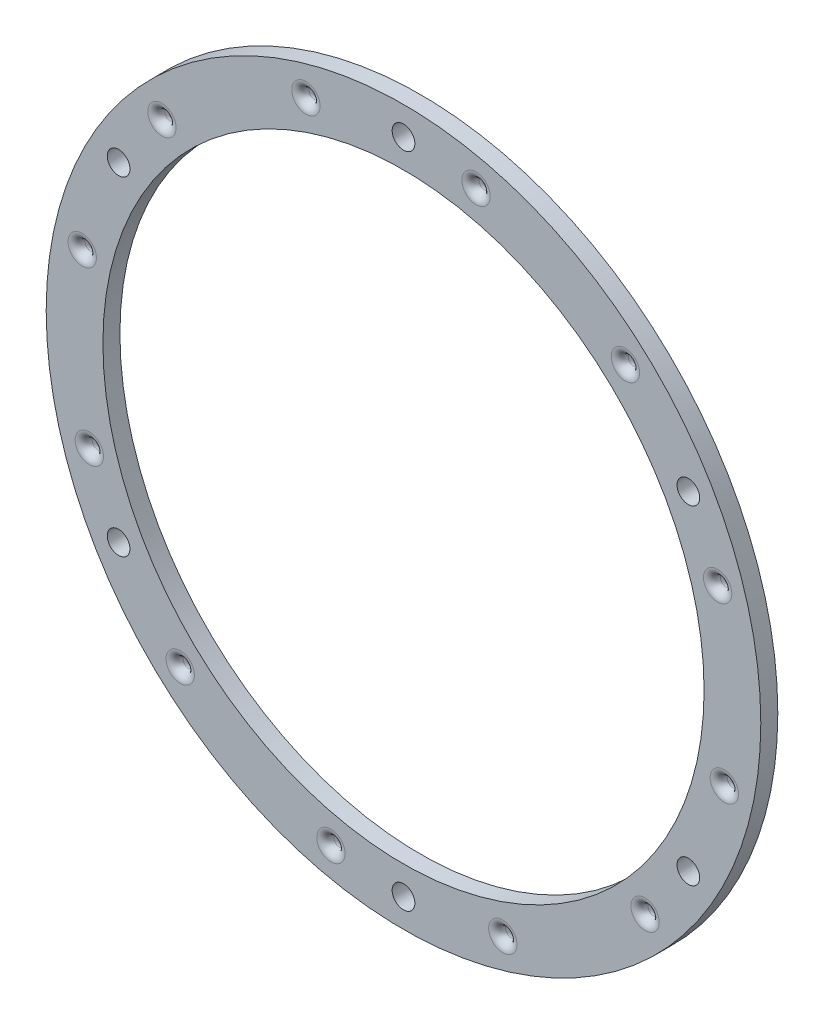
ISO-10303-21;
HEADER;
FILE_DESCRIPTION(('STEP AP214'),'2;1');
FILE_NAME('part.step','',(''),(''),'','','');
FILE_SCHEMA(('AUTOMOTIVE_DESIGN { 1 0 10303 214 1 1 1 1 }'));
ENDSEC;
DATA;
#1=APPLICATION_CONTEXT('core data for automotive mechanical design processes');
#2=APPLICATION_PROTOCOL_DEFINITION('international standard','automotive_design',2000,#1);
#3=PRODUCT_CONTEXT('',#1,'mechanical');
#4=PRODUCT('Part','Part','',(#3));
#5=PRODUCT_RELATED_PRODUCT_CATEGORY('part','',(#4));
#6=PRODUCT_DEFINITION_FORMATION('','',#4);
#7=PRODUCT_DEFINITION_CONTEXT('part definition',#1,'design');
#8=PRODUCT_DEFINITION('design','',#6,#7);
#9=PRODUCT_DEFINITION_SHAPE('','',#8);
#10=(LENGTH_UNIT() NAMED_UNIT(*) SI_UNIT(.MILLI.,.METRE.));
#11=(NAMED_UNIT(*) PLANE_ANGLE_UNIT() SI_UNIT($,.RADIAN.));
#12=(NAMED_UNIT(*) SI_UNIT($,.STERADIAN.) SOLID_ANGLE_UNIT());
#13=UNCERTAINTY_MEASURE_WITH_UNIT(LENGTH_MEASURE(1.E-05),#10,'distance_accuracy_value','');
#14=(GEOMETRIC_REPRESENTATION_CONTEXT(3) GLOBAL_UNCERTAINTY_ASSIGNED_CONTEXT((#13)) GLOBAL_UNIT_ASSIGNED_CONTEXT((#10,
#11,#12)) REPRESENTATION_CONTEXT('',''));
#15=CARTESIAN_POINT('',(0.,0.,0.));
#16=DIRECTION('',(0.,0.,1.));
#17=DIRECTION('',(1.,0.,0.));
#18=AXIS2_PLACEMENT_3D('',#15,#16,#17);
#19=CARTESIAN_POINT('',(0.,0.,3.));
#20=DIRECTION('',(0.,0.,1.));
#21=DIRECTION('',(1.,0.,0.));
#22=AXIS2_PLACEMENT_3D('',#19,#20,#21);
#23=PLANE('',#22);
#24=CARTESIAN_POINT('',(12.79627582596,56.5707992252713,3.));
#25=DIRECTION('',(0.,0.,1.));
#26=DIRECTION('',(1.,0.,0.));
#27=AXIS2_PLACEMENT_3D('',#24,#25,#26);
#28=CIRCLE('',#27,2.5);
#29=CARTESIAN_POINT('',(15.29627582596,56.5707992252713,3.));
#30=VERTEX_POINT('',#29);
#31=EDGE_CURVE('E10',#30,#30,#28,.F.);
#32=ORIENTED_EDGE('',*,*,#31,.T.);
#33=EDGE_LOOP('',(#32));
#34=FACE_BOUND('',#33,.T.);
#35=CARTESIAN_POINT('',(39.1279323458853,42.8136066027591,3.));
#36=DIRECTION('',(0.,0.,1.));
#37=DIRECTION('',(1.,0.,0.));
#38=AXIS2_PLACEMENT_3D('',#35,#36,#37);
#39=CIRCLE('',#38,2.5);
#40=CARTESIAN_POINT('',(41.6279323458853,42.8136066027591,3.));
#41=VERTEX_POINT('',#40);
#42=EDGE_CURVE('E52',#41,#41,#39,.F.);
#43=ORIENTED_EDGE('',*,*,#42,.T.);
#44=EDGE_LOOP('',(#43));
#45=FACE_BOUND('',#44,.T.);
#46=CARTESIAN_POINT('',(55.38988715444,17.2034996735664,3.));
#47=DIRECTION('',(0.,0.,1.));
#48=DIRECTION('',(1.,0.,0.));
#49=AXIS2_PLACEMENT_3D('',#46,#47,#48);
#50=CIRCLE('',#49,2.5);
#51=CARTESIAN_POINT('',(57.88988715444,17.2034996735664,3.));
#52=VERTEX_POINT('',#51);
#53=EDGE_CURVE('E60',#52,#52,#50,.F.);
#54=ORIENTED_EDGE('',*,*,#53,.T.);
#55=EDGE_LOOP('',(#54));
#56=FACE_BOUND('',#55,.T.);
#57=CARTESIAN_POINT('',(56.5707992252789,-12.7962758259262,3.));
#58=DIRECTION('',(0.,0.,1.));
#59=DIRECTION('',(1.,0.,0.));
#60=AXIS2_PLACEMENT_3D('',#57,#58,#59);
#61=CIRCLE('',#60,2.5);
#62=CARTESIAN_POINT('',(59.0707992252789,-12.7962758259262,3.));
#63=VERTEX_POINT('',#62);
#64=EDGE_CURVE('E251',#63,#63,#61,.F.);
#65=ORIENTED_EDGE('',*,*,#64,.T.);
#66=EDGE_LOOP('',(#65));
#67=FACE_BOUND('',#66,.T.);
#68=CARTESIAN_POINT('',(42.5936113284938,-39.3672995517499,3.));
#69=DIRECTION('',(0.,0.,1.));
#70=DIRECTION('',(1.,0.,0.));
#71=AXIS2_PLACEMENT_3D('',#68,#69,#70);
#72=CIRCLE('',#71,2.5);
#73=CARTESIAN_POINT('',(45.0936113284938,-39.3672995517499,3.));
#74=VERTEX_POINT('',#73);
#75=EDGE_CURVE('E240',#74,#74,#72,.F.);
#76=ORIENTED_EDGE('',*,*,#75,.T.);
#77=EDGE_LOOP('',(#76));
#78=FACE_BOUND('',#77,.T.);
#79=CARTESIAN_POINT('',(17.5137047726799,-55.2925867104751,3.));
#80=DIRECTION('',(0.,0.,1.));
#81=DIRECTION('',(1.,0.,0.));
#82=AXIS2_PLACEMENT_3D('',#79,#80,#81);
#83=CIRCLE('',#82,2.5);
#84=CARTESIAN_POINT('',(20.0137047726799,-55.2925867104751,3.));
#85=VERTEX_POINT('',#84);
#86=EDGE_CURVE('E233',#85,#85,#83,.F.);
#87=ORIENTED_EDGE('',*,*,#86,.T.);
#88=EDGE_LOOP('',(#87));
#89=FACE_BOUND('',#88,.T.);
#90=CARTESIAN_POINT('',(-12.7962758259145,-56.5707992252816,3.));
#91=DIRECTION('',(0.,0.,1.));
#92=DIRECTION('',(1.,0.,0.));
#93=AXIS2_PLACEMENT_3D('',#90,#91,#92);
#94=CIRCLE('',#93,2.5);
#95=CARTESIAN_POINT('',(-10.2962758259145,-56.5707992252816,3.));
#96=VERTEX_POINT('',#95);
#97=EDGE_CURVE('E230',#96,#96,#94,.F.);
#98=ORIENTED_EDGE('',*,*,#97,.T.);
#99=EDGE_LOOP('',(#98));
#100=FACE_BOUND('',#99,.T.);
#101=CARTESIAN_POINT('',(-39.3672995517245,-42.5936113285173,3.));
#102=DIRECTION('',(0.,0.,1.));
#103=DIRECTION('',(1.,0.,0.));
#104=AXIS2_PLACEMENT_3D('',#101,#102,#103);
#105=CIRCLE('',#104,2.5);
#106=CARTESIAN_POINT('',(-36.8672995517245,-42.5936113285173,3.));
#107=VERTEX_POINT('',#106);
#108=EDGE_CURVE('E234',#107,#107,#105,.F.);
#109=ORIENTED_EDGE('',*,*,#108,.T.);
#110=EDGE_LOOP('',(#109));
#111=FACE_BOUND('',#110,.T.);
#112=CARTESIAN_POINT('',(-55.3898871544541,-17.2034996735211,3.));
#113=DIRECTION('',(0.,0.,1.));
#114=DIRECTION('',(1.,0.,0.));
#115=AXIS2_PLACEMENT_3D('',#112,#113,#114);
#116=CIRCLE('',#115,2.5);
#117=CARTESIAN_POINT('',(-52.8898871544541,-17.2034996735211,3.));
#118=VERTEX_POINT('',#117);
#119=EDGE_CURVE('E244',#118,#118,#116,.F.);
#120=ORIENTED_EDGE('',*,*,#119,.T.);
#121=EDGE_LOOP('',(#120));
#122=FACE_BOUND('',#121,.T.);
#123=CARTESIAN_POINT('',(-56.6416371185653,12.478980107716,3.));
#124=DIRECTION('',(0.,0.,1.));
#125=DIRECTION('',(1.,0.,0.));
#126=AXIS2_PLACEMENT_3D('',#123,#124,#125);
#127=CIRCLE('',#126,2.5);
#128=CARTESIAN_POINT('',(-54.1416371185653,12.478980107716,3.));
#129=VERTEX_POINT('',#128);
#130=EDGE_CURVE('E305',#129,#129,#127,.F.);
#131=ORIENTED_EDGE('',*,*,#130,.T.);
#132=EDGE_LOOP('',(#131));
#133=FACE_BOUND('',#132,.T.);
#134=CARTESIAN_POINT('',(-42.5936113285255,39.3672995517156,3.));
#135=DIRECTION('',(0.,0.,1.));
#136=DIRECTION('',(1.,0.,0.));
#137=AXIS2_PLACEMENT_3D('',#134,#135,#136);
#138=CIRCLE('',#137,2.5);
#139=CARTESIAN_POINT('',(-40.0936113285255,39.3672995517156,3.));
#140=VERTEX_POINT('',#139);
#141=EDGE_CURVE('E301',#140,#140,#138,.F.);
#142=ORIENTED_EDGE('',*,*,#141,.T.);
#143=EDGE_LOOP('',(#142));
#144=FACE_BOUND('',#143,.T.);
#145=CARTESIAN_POINT('',(-17.2034996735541,55.3898871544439,3.));
#146=DIRECTION('',(0.,0.,1.));
#147=DIRECTION('',(1.,0.,0.));
#148=AXIS2_PLACEMENT_3D('',#145,#146,#147);
#149=CIRCLE('',#148,2.5);
#150=CARTESIAN_POINT('',(-14.7034996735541,55.3898871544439,3.));
#151=VERTEX_POINT('',#150);
#152=EDGE_CURVE('E297',#151,#151,#149,.F.);
#153=ORIENTED_EDGE('',*,*,#152,.T.);
#154=EDGE_LOOP('',(#153));
#155=FACE_BOUND('',#154,.T.);
#156=CARTESIAN_POINT('',(0.,-58.0000000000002,3.));
#157=DIRECTION('',(0.,0.,1.));
#158=DIRECTION('',(1.,0.,0.));
#159=AXIS2_PLACEMENT_3D('',#156,#157,#158);
#160=CIRCLE('',#159,2.0000000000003);
#161=CARTESIAN_POINT('',(2.00000000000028,-58.0000000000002,3.));
#162=VERTEX_POINT('',#161);
#163=EDGE_CURVE('E389',#162,#162,#160,.T.);
#164=ORIENTED_EDGE('',*,*,#163,.F.);
#165=EDGE_LOOP('',(#164));
#166=FACE_BOUND('',#165,.T.);
#167=CARTESIAN_POINT('',(50.2294734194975,-29.0000000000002,3.));
#168=DIRECTION('',(0.,0.,1.));
#169=DIRECTION('',(1.,0.,0.));
#170=AXIS2_PLACEMENT_3D('',#167,#168,#169);
#171=CIRCLE('',#170,2.00000000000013);
#172=CARTESIAN_POINT('',(52.2294734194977,-29.0000000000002,3.));
#173=VERTEX_POINT('',#172);
#174=EDGE_CURVE('E394',#173,#173,#171,.T.);
#175=ORIENTED_EDGE('',*,*,#174,.F.);
#176=EDGE_LOOP('',(#175));
#177=FACE_BOUND('',#176,.T.);
#178=CARTESIAN_POINT('',(50.2294734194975,28.9999999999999,3.));
#179=DIRECTION('',(0.,0.,1.));
#180=DIRECTION('',(1.,0.,0.));
#181=AXIS2_PLACEMENT_3D('',#178,#179,#180);
#182=CIRCLE('',#181,2.00000000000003);
#183=CARTESIAN_POINT('',(52.2294734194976,28.9999999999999,3.));
#184=VERTEX_POINT('',#183);
#185=EDGE_CURVE('E400',#184,#184,#182,.T.);
#186=ORIENTED_EDGE('',*,*,#185,.F.);
#187=EDGE_LOOP('',(#186));
#188=FACE_BOUND('',#187,.T.);
#189=CARTESIAN_POINT('',(0.,0.,3.));
#190=DIRECTION('',(0.,0.,1.));
#191=DIRECTION('',(1.,0.,0.));
#192=AXIS2_PLACEMENT_3D('',#189,#190,#191);
#193=CIRCLE('',#192,53.);
#194=CARTESIAN_POINT('',(53.,0.,3.));
#195=VERTEX_POINT('',#194);
#196=EDGE_CURVE('E406',#195,#195,#193,.T.);
#197=ORIENTED_EDGE('',*,*,#196,.F.);
#198=EDGE_LOOP('',(#197));
#199=FACE_BOUND('',#198,.T.);
#200=CARTESIAN_POINT('',(0.,0.,3.));
#201=DIRECTION('',(0.,0.,1.));
#202=DIRECTION('',(1.,0.,0.));
#203=AXIS2_PLACEMENT_3D('',#200,#201,#202);
#204=CIRCLE('',#203,63.);
#205=CARTESIAN_POINT('',(63.,0.,3.));
#206=VERTEX_POINT('',#205);
#207=EDGE_CURVE('E417',#206,#206,#204,.T.);
#208=ORIENTED_EDGE('',*,*,#207,.T.);
#209=EDGE_LOOP('',(#208));
#210=FACE_BOUND('',#209,.T.);
#211=CARTESIAN_POINT('',(0.,58.,3.));
#212=DIRECTION('',(0.,0.,1.));
#213=DIRECTION('',(1.,0.,0.));
#214=AXIS2_PLACEMENT_3D('',#211,#212,#213);
#215=CIRCLE('',#214,2.);
#216=CARTESIAN_POINT('',(2.,58.,3.));
#217=VERTEX_POINT('',#216);
#218=EDGE_CURVE('E411',#217,#217,#215,.T.);
#219=ORIENTED_EDGE('',*,*,#218,.F.);
#220=EDGE_LOOP('',(#219));
#221=FACE_BOUND('',#220,.T.);
#222=CARTESIAN_POINT('',(-50.2294734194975,-29.0000000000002,3.));
#223=DIRECTION('',(0.,0.,1.));
#224=DIRECTION('',(1.,0.,0.));
#225=AXIS2_PLACEMENT_3D('',#222,#223,#224);
#226=CIRCLE('',#225,2.00000000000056);
#227=CARTESIAN_POINT('',(-48.229473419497,-29.0000000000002,3.));
#228=VERTEX_POINT('',#227);
#229=EDGE_CURVE('E384',#228,#228,#226,.T.);
#230=ORIENTED_EDGE('',*,*,#229,.F.);
#231=EDGE_LOOP('',(#230));
#232=FACE_BOUND('',#231,.T.);
#233=CARTESIAN_POINT('',(-50.2294734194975,29.,3.));
#234=DIRECTION('',(0.,0.,1.));
#235=DIRECTION('',(1.,0.,0.));
#236=AXIS2_PLACEMENT_3D('',#233,#234,#235);
#237=CIRCLE('',#236,2.0000000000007);
#238=CARTESIAN_POINT('',(-48.2294734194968,29.,3.));
#239=VERTEX_POINT('',#238);
#240=EDGE_CURVE('E377',#239,#239,#237,.T.);
#241=ORIENTED_EDGE('',*,*,#240,.F.);
#242=EDGE_LOOP('',(#241));
#243=FACE_BOUND('',#242,.T.);
#244=ADVANCED_FACE('F43',(#34,#45,#56,#67,#78,#89,#100,#111,#122,#133,#144,#155,#166,#177,#188,
#199,#210,#221,#232,#243),#23,.T.);
#245=CARTESIAN_POINT('',(0.,0.,0.));
#246=DIRECTION('',(0.,0.,1.));
#247=DIRECTION('',(1.,0.,0.));
#248=AXIS2_PLACEMENT_3D('',#245,#246,#247);
#249=PLANE('',#248);
#250=CARTESIAN_POINT('',(-55.3898871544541,-17.2034996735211,0.));
#251=DIRECTION('',(0.,0.,1.));
#252=DIRECTION('',(1.,0.,0.));
#253=AXIS2_PLACEMENT_3D('',#250,#251,#252);
#254=CIRCLE('',#253,2.5);
#255=CARTESIAN_POINT('',(-52.8898871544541,-17.2034996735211,0.));
#256=VERTEX_POINT('',#255);
#257=EDGE_CURVE('E293',#256,#256,#254,.T.);
#258=ORIENTED_EDGE('',*,*,#257,.T.);
#259=EDGE_LOOP('',(#258));
#260=FACE_BOUND('',#259,.T.);
#261=CARTESIAN_POINT('',(-56.6416371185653,12.478980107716,0.));
#262=DIRECTION('',(0.,0.,1.));
#263=DIRECTION('',(1.,0.,0.));
#264=AXIS2_PLACEMENT_3D('',#261,#262,#263);
#265=CIRCLE('',#264,2.5);
#266=CARTESIAN_POINT('',(-54.1416371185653,12.478980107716,0.));
#267=VERTEX_POINT('',#266);
#268=EDGE_CURVE('E289',#267,#267,#265,.T.);
#269=ORIENTED_EDGE('',*,*,#268,.T.);
#270=EDGE_LOOP('',(#269));
#271=FACE_BOUND('',#270,.T.);
#272=CARTESIAN_POINT('',(-42.5936113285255,39.3672995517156,0.));
#273=DIRECTION('',(0.,0.,1.));
#274=DIRECTION('',(1.,0.,0.));
#275=AXIS2_PLACEMENT_3D('',#272,#273,#274);
#276=CIRCLE('',#275,2.5);
#277=CARTESIAN_POINT('',(-40.0936113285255,39.3672995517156,0.));
#278=VERTEX_POINT('',#277);
#279=EDGE_CURVE('E286',#278,#278,#276,.T.);
#280=ORIENTED_EDGE('',*,*,#279,.T.);
#281=EDGE_LOOP('',(#280));
#282=FACE_BOUND('',#281,.T.);
#283=CARTESIAN_POINT('',(-17.2034996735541,55.3898871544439,0.));
#284=DIRECTION('',(0.,0.,1.));
#285=DIRECTION('',(1.,0.,0.));
#286=AXIS2_PLACEMENT_3D('',#283,#284,#285);
#287=CIRCLE('',#286,2.5);
#288=CARTESIAN_POINT('',(-14.7034996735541,55.3898871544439,0.));
#289=VERTEX_POINT('',#288);
#290=EDGE_CURVE('E282',#289,#289,#287,.T.);
#291=ORIENTED_EDGE('',*,*,#290,.T.);
#292=EDGE_LOOP('',(#291));
#293=FACE_BOUND('',#292,.T.);
#294=CARTESIAN_POINT('',(12.79627582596,56.5707992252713,0.));
#295=DIRECTION('',(0.,0.,1.));
#296=DIRECTION('',(1.,0.,0.));
#297=AXIS2_PLACEMENT_3D('',#294,#295,#296);
#298=CIRCLE('',#297,2.5);
#299=CARTESIAN_POINT('',(15.29627582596,56.5707992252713,0.));
#300=VERTEX_POINT('',#299);
#301=EDGE_CURVE('E272',#300,#300,#298,.T.);
#302=ORIENTED_EDGE('',*,*,#301,.T.);
#303=EDGE_LOOP('',(#302));
#304=FACE_BOUND('',#303,.T.);
#305=CARTESIAN_POINT('',(39.1279323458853,42.8136066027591,0.));
#306=DIRECTION('',(0.,0.,1.));
#307=DIRECTION('',(1.,0.,0.));
#308=AXIS2_PLACEMENT_3D('',#305,#306,#307);
#309=CIRCLE('',#308,2.5);
#310=CARTESIAN_POINT('',(41.6279323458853,42.8136066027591,0.));
#311=VERTEX_POINT('',#310);
#312=EDGE_CURVE('E267',#311,#311,#309,.T.);
#313=ORIENTED_EDGE('',*,*,#312,.T.);
#314=EDGE_LOOP('',(#313));
#315=FACE_BOUND('',#314,.T.);
#316=CARTESIAN_POINT('',(55.38988715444,17.2034996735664,0.));
#317=DIRECTION('',(0.,0.,1.));
#318=DIRECTION('',(1.,0.,0.));
#319=AXIS2_PLACEMENT_3D('',#316,#317,#318);
#320=CIRCLE('',#319,2.5);
#321=CARTESIAN_POINT('',(57.88988715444,17.2034996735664,0.));
#322=VERTEX_POINT('',#321);
#323=EDGE_CURVE('E264',#322,#322,#320,.T.);
#324=ORIENTED_EDGE('',*,*,#323,.T.);
#325=EDGE_LOOP('',(#324));
#326=FACE_BOUND('',#325,.T.);
#327=CARTESIAN_POINT('',(56.5707992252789,-12.7962758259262,0.));
#328=DIRECTION('',(0.,0.,1.));
#329=DIRECTION('',(1.,0.,0.));
#330=AXIS2_PLACEMENT_3D('',#327,#328,#329);
#331=CIRCLE('',#330,2.5);
#332=CARTESIAN_POINT('',(59.0707992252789,-12.7962758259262,0.));
#333=VERTEX_POINT('',#332);
#334=EDGE_CURVE('E268',#333,#333,#331,.T.);
#335=ORIENTED_EDGE('',*,*,#334,.T.);
#336=EDGE_LOOP('',(#335));
#337=FACE_BOUND('',#336,.T.);
#338=CARTESIAN_POINT('',(42.5936113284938,-39.3672995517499,0.));
#339=DIRECTION('',(0.,0.,1.));
#340=DIRECTION('',(1.,0.,0.));
#341=AXIS2_PLACEMENT_3D('',#338,#339,#340);
#342=CIRCLE('',#341,2.5);
#343=CARTESIAN_POINT('',(45.0936113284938,-39.3672995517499,0.));
#344=VERTEX_POINT('',#343);
#345=EDGE_CURVE('E276',#344,#344,#342,.T.);
#346=ORIENTED_EDGE('',*,*,#345,.T.);
#347=EDGE_LOOP('',(#346));
#348=FACE_BOUND('',#347,.T.);
#349=CARTESIAN_POINT('',(17.5137047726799,-55.2925867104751,0.));
#350=DIRECTION('',(0.,0.,1.));
#351=DIRECTION('',(1.,0.,0.));
#352=AXIS2_PLACEMENT_3D('',#349,#350,#351);
#353=CIRCLE('',#352,2.5);
#354=CARTESIAN_POINT('',(20.0137047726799,-55.2925867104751,0.));
#355=VERTEX_POINT('',#354);
#356=EDGE_CURVE('E336',#355,#355,#353,.T.);
#357=ORIENTED_EDGE('',*,*,#356,.T.);
#358=EDGE_LOOP('',(#357));
#359=FACE_BOUND('',#358,.T.);
#360=CARTESIAN_POINT('',(-12.7962758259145,-56.5707992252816,0.));
#361=DIRECTION('',(0.,0.,1.));
#362=DIRECTION('',(1.,0.,0.));
#363=AXIS2_PLACEMENT_3D('',#360,#361,#362);
#364=CIRCLE('',#363,2.5);
#365=CARTESIAN_POINT('',(-10.2962758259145,-56.5707992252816,0.));
#366=VERTEX_POINT('',#365);
#367=EDGE_CURVE('E340',#366,#366,#364,.T.);
#368=ORIENTED_EDGE('',*,*,#367,.T.);
#369=EDGE_LOOP('',(#368));
#370=FACE_BOUND('',#369,.T.);
#371=CARTESIAN_POINT('',(-39.3672995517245,-42.5936113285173,0.));
#372=DIRECTION('',(0.,0.,1.));
#373=DIRECTION('',(1.,0.,0.));
#374=AXIS2_PLACEMENT_3D('',#371,#372,#373);
#375=CIRCLE('',#374,2.5);
#376=CARTESIAN_POINT('',(-36.8672995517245,-42.5936113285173,0.));
#377=VERTEX_POINT('',#376);
#378=EDGE_CURVE('E344',#377,#377,#375,.T.);
#379=ORIENTED_EDGE('',*,*,#378,.T.);
#380=EDGE_LOOP('',(#379));
#381=FACE_BOUND('',#380,.T.);
#382=CARTESIAN_POINT('',(0.,0.,0.));
#383=DIRECTION('',(0.,0.,1.));
#384=DIRECTION('',(1.,0.,0.));
#385=AXIS2_PLACEMENT_3D('',#382,#383,#384);
#386=CIRCLE('',#385,63.);
#387=CARTESIAN_POINT('',(63.,0.,0.));
#388=VERTEX_POINT('',#387);
#389=EDGE_CURVE('E348',#388,#388,#386,.T.);
#390=ORIENTED_EDGE('',*,*,#389,.F.);
#391=EDGE_LOOP('',(#390));
#392=FACE_BOUND('',#391,.T.);
#393=CARTESIAN_POINT('',(0.,58.,0.));
#394=DIRECTION('',(0.,0.,1.));
#395=DIRECTION('',(1.,0.,0.));
#396=AXIS2_PLACEMENT_3D('',#393,#394,#395);
#397=CIRCLE('',#396,2.);
#398=CARTESIAN_POINT('',(2.,58.,0.));
#399=VERTEX_POINT('',#398);
#400=EDGE_CURVE('E352',#399,#399,#397,.T.);
#401=ORIENTED_EDGE('',*,*,#400,.T.);
#402=EDGE_LOOP('',(#401));
#403=FACE_BOUND('',#402,.T.);
#404=CARTESIAN_POINT('',(0.,0.,0.));
#405=DIRECTION('',(0.,0.,1.));
#406=DIRECTION('',(1.,0.,0.));
#407=AXIS2_PLACEMENT_3D('',#404,#405,#406);
#408=CIRCLE('',#407,53.);
#409=CARTESIAN_POINT('',(53.,0.,0.));
#410=VERTEX_POINT('',#409);
#411=EDGE_CURVE('E356',#410,#410,#408,.T.);
#412=ORIENTED_EDGE('',*,*,#411,.T.);
#413=EDGE_LOOP('',(#412));
#414=FACE_BOUND('',#413,.T.);
#415=CARTESIAN_POINT('',(50.2294734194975,28.9999999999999,0.));
#416=DIRECTION('',(0.,0.,1.));
#417=DIRECTION('',(1.,0.,0.));
#418=AXIS2_PLACEMENT_3D('',#415,#416,#417);
#419=CIRCLE('',#418,2.00000000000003);
#420=CARTESIAN_POINT('',(52.2294734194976,28.9999999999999,0.));
#421=VERTEX_POINT('',#420);
#422=EDGE_CURVE('E360',#421,#421,#419,.T.);
#423=ORIENTED_EDGE('',*,*,#422,.T.);
#424=EDGE_LOOP('',(#423));
#425=FACE_BOUND('',#424,.T.);
#426=CARTESIAN_POINT('',(50.2294734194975,-29.0000000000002,0.));
#427=DIRECTION('',(0.,0.,1.));
#428=DIRECTION('',(1.,0.,0.));
#429=AXIS2_PLACEMENT_3D('',#426,#427,#428);
#430=CIRCLE('',#429,2.00000000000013);
#431=CARTESIAN_POINT('',(52.2294734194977,-29.0000000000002,0.));
#432=VERTEX_POINT('',#431);
#433=EDGE_CURVE('E364',#432,#432,#430,.T.);
#434=ORIENTED_EDGE('',*,*,#433,.T.);
#435=EDGE_LOOP('',(#434));
#436=FACE_BOUND('',#435,.T.);
#437=CARTESIAN_POINT('',(0.,-58.0000000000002,0.));
#438=DIRECTION('',(0.,0.,1.));
#439=DIRECTION('',(1.,0.,0.));
#440=AXIS2_PLACEMENT_3D('',#437,#438,#439);
#441=CIRCLE('',#440,2.0000000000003);
#442=CARTESIAN_POINT('',(2.00000000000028,-58.0000000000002,0.));
#443=VERTEX_POINT('',#442);
#444=EDGE_CURVE('E368',#443,#443,#441,.T.);
#445=ORIENTED_EDGE('',*,*,#444,.T.);
#446=EDGE_LOOP('',(#445));
#447=FACE_BOUND('',#446,.T.);
#448=CARTESIAN_POINT('',(-50.2294734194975,-29.0000000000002,0.));
#449=DIRECTION('',(0.,0.,1.));
#450=DIRECTION('',(1.,0.,0.));
#451=AXIS2_PLACEMENT_3D('',#448,#449,#450);
#452=CIRCLE('',#451,2.00000000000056);
#453=CARTESIAN_POINT('',(-48.229473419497,-29.0000000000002,0.));
#454=VERTEX_POINT('',#453);
#455=EDGE_CURVE('E372',#454,#454,#452,.T.);
#456=ORIENTED_EDGE('',*,*,#455,.T.);
#457=EDGE_LOOP('',(#456));
#458=FACE_BOUND('',#457,.T.);
#459=CARTESIAN_POINT('',(-50.2294734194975,29.,0.));
#460=DIRECTION('',(0.,0.,1.));
#461=DIRECTION('',(1.,0.,0.));
#462=AXIS2_PLACEMENT_3D('',#459,#460,#461);
#463=CIRCLE('',#462,2.0000000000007);
#464=CARTESIAN_POINT('',(-48.2294734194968,29.,0.));
#465=VERTEX_POINT('',#464);
#466=EDGE_CURVE('E68',#465,#465,#463,.T.);
#467=ORIENTED_EDGE('',*,*,#466,.T.);
#468=EDGE_LOOP('',(#467));
#469=FACE_BOUND('',#468,.T.);
#470=ADVANCED_FACE('F128',(#260,#271,#282,#293,#304,#315,#326,#337,#348,#359,#370,#381,#392,
#403,#414,#425,#436,#447,#458,#469),#249,.F.);
#471=CARTESIAN_POINT('',(0.,0.,3.));
#472=DIRECTION('',(0.,0.,-1.));
#473=DIRECTION('',(-1.,0.,0.));
#474=AXIS2_PLACEMENT_3D('',#471,#472,#473);
#475=CYLINDRICAL_SURFACE('',#474,63.);
#476=ORIENTED_EDGE('',*,*,#207,.F.);
#477=EDGE_LOOP('',(#476));
#478=FACE_BOUND('',#477,.T.);
#479=ORIENTED_EDGE('',*,*,#389,.T.);
#480=EDGE_LOOP('',(#479));
#481=FACE_BOUND('',#480,.T.);
#482=ADVANCED_FACE('F132',(#478,#481),#475,.T.);
#483=CARTESIAN_POINT('',(0.,58.,3.));
#484=DIRECTION('',(0.,0.,-1.));
#485=DIRECTION('',(-1.,0.,0.));
#486=AXIS2_PLACEMENT_3D('',#483,#484,#485);
#487=CYLINDRICAL_SURFACE('',#486,2.);
#488=ORIENTED_EDGE('',*,*,#218,.T.);
#489=EDGE_LOOP('',(#488));
#490=FACE_BOUND('',#489,.T.);
#491=ORIENTED_EDGE('',*,*,#400,.F.);
#492=EDGE_LOOP('',(#491));
#493=FACE_BOUND('',#492,.T.);
#494=ADVANCED_FACE('F137',(#490,#493),#487,.F.);
#495=CARTESIAN_POINT('',(0.,0.,3.));
#496=DIRECTION('',(0.,0.,-1.));
#497=DIRECTION('',(-1.,0.,0.));
#498=AXIS2_PLACEMENT_3D('',#495,#496,#497);
#499=CYLINDRICAL_SURFACE('',#498,53.);
#500=ORIENTED_EDGE('',*,*,#196,.T.);
#501=EDGE_LOOP('',(#500));
#502=FACE_BOUND('',#501,.T.);
#503=ORIENTED_EDGE('',*,*,#411,.F.);
#504=EDGE_LOOP('',(#503));
#505=FACE_BOUND('',#504,.T.);
#506=ADVANCED_FACE('F455',(#502,#505),#499,.F.);
#507=CARTESIAN_POINT('',(50.2294734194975,28.9999999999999,3.));
#508=DIRECTION('',(0.,0.,-1.));
#509=DIRECTION('',(-1.,0.,0.));
#510=AXIS2_PLACEMENT_3D('',#507,#508,#509);
#511=CYLINDRICAL_SURFACE('',#510,2.00000000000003);
#512=ORIENTED_EDGE('',*,*,#185,.T.);
#513=EDGE_LOOP('',(#512));
#514=FACE_BOUND('',#513,.T.);
#515=ORIENTED_EDGE('',*,*,#422,.F.);
#516=EDGE_LOOP('',(#515));
#517=FACE_BOUND('',#516,.T.);
#518=ADVANCED_FACE('F452',(#514,#517),#511,.F.);
#519=CARTESIAN_POINT('',(50.2294734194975,-29.0000000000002,3.));
#520=DIRECTION('',(0.,0.,-1.));
#521=DIRECTION('',(-1.,0.,0.));
#522=AXIS2_PLACEMENT_3D('',#519,#520,#521);
#523=CYLINDRICAL_SURFACE('',#522,2.00000000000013);
#524=ORIENTED_EDGE('',*,*,#174,.T.);
#525=EDGE_LOOP('',(#524));
#526=FACE_BOUND('',#525,.T.);
#527=ORIENTED_EDGE('',*,*,#433,.F.);
#528=EDGE_LOOP('',(#527));
#529=FACE_BOUND('',#528,.T.);
#530=ADVANCED_FACE('F448',(#526,#529),#523,.F.);
#531=CARTESIAN_POINT('',(0.,-58.0000000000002,3.));
#532=DIRECTION('',(0.,0.,-1.));
#533=DIRECTION('',(-1.,0.,0.));
#534=AXIS2_PLACEMENT_3D('',#531,#532,#533);
#535=CYLINDRICAL_SURFACE('',#534,2.0000000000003);
#536=ORIENTED_EDGE('',*,*,#163,.T.);
#537=EDGE_LOOP('',(#536));
#538=FACE_BOUND('',#537,.T.);
#539=ORIENTED_EDGE('',*,*,#444,.F.);
#540=EDGE_LOOP('',(#539));
#541=FACE_BOUND('',#540,.T.);
#542=ADVANCED_FACE('F442',(#538,#541),#535,.F.);
#543=CARTESIAN_POINT('',(-50.2294734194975,-29.0000000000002,3.));
#544=DIRECTION('',(0.,0.,-1.));
#545=DIRECTION('',(-1.,0.,0.));
#546=AXIS2_PLACEMENT_3D('',#543,#544,#545);
#547=CYLINDRICAL_SURFACE('',#546,2.00000000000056);
#548=ORIENTED_EDGE('',*,*,#229,.T.);
#549=EDGE_LOOP('',(#548));
#550=FACE_BOUND('',#549,.T.);
#551=ORIENTED_EDGE('',*,*,#455,.F.);
#552=EDGE_LOOP('',(#551));
#553=FACE_BOUND('',#552,.T.);
#554=ADVANCED_FACE('F438',(#550,#553),#547,.F.);
#555=CARTESIAN_POINT('',(-50.2294734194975,29.,3.));
#556=DIRECTION('',(0.,0.,-1.));
#557=DIRECTION('',(-1.,0.,0.));
#558=AXIS2_PLACEMENT_3D('',#555,#556,#557);
#559=CYLINDRICAL_SURFACE('',#558,2.0000000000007);
#560=ORIENTED_EDGE('',*,*,#240,.T.);
#561=EDGE_LOOP('',(#560));
#562=FACE_BOUND('',#561,.T.);
#563=ORIENTED_EDGE('',*,*,#466,.F.);
#564=EDGE_LOOP('',(#563));
#565=FACE_BOUND('',#564,.T.);
#566=ADVANCED_FACE('F151',(#562,#565),#559,.F.);
#567=CARTESIAN_POINT('',(-55.3898871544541,-17.2034996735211,1.5));
#568=DIRECTION('',(0.,0.,1.));
#569=DIRECTION('',(1.,0.,0.));
#570=AXIS2_PLACEMENT_3D('',#567,#568,#569);
#571=TOROIDAL_SURFACE('',#570,2.5,1.5);
#572=ORIENTED_EDGE('',*,*,#119,.F.);
#573=EDGE_LOOP('',(#572));
#574=FACE_BOUND('',#573,.T.);
#575=CARTESIAN_POINT('',(-55.3898871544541,-17.2034996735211,1.5));
#576=DIRECTION('',(0.,0.,1.));
#577=DIRECTION('',(1.,0.,0.));
#578=AXIS2_PLACEMENT_3D('',#575,#576,#577);
#579=CIRCLE('',#578,1.);
#580=CARTESIAN_POINT('',(-54.3898871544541,-17.2034996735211,1.5));
#581=VERTEX_POINT('',#580);
#582=EDGE_CURVE('E64',#581,#581,#579,.T.);
#583=ORIENTED_EDGE('',*,*,#582,.F.);
#584=EDGE_LOOP('',(#583));
#585=FACE_BOUND('',#584,.T.);
#586=ADVANCED_FACE('F147',(#574,#585),#571,.T.);
#587=CARTESIAN_POINT('',(-55.3898871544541,-17.2034996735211,1.5));
#588=DIRECTION('',(0.,0.,1.));
#589=DIRECTION('',(1.,0.,0.));
#590=AXIS2_PLACEMENT_3D('',#587,#588,#589);
#591=TOROIDAL_SURFACE('',#590,2.5,1.5);
#592=ORIENTED_EDGE('',*,*,#582,.T.);
#593=EDGE_LOOP('',(#592));
#594=FACE_BOUND('',#593,.T.);
#595=ORIENTED_EDGE('',*,*,#257,.F.);
#596=EDGE_LOOP('',(#595));
#597=FACE_BOUND('',#596,.T.);
#598=ADVANCED_FACE('F143',(#594,#597),#591,.T.);
#599=CARTESIAN_POINT('',(-56.6416371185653,12.478980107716,1.5));
#600=DIRECTION('',(0.,0.,1.));
#601=DIRECTION('',(1.,0.,0.));
#602=AXIS2_PLACEMENT_3D('',#599,#600,#601);
#603=TOROIDAL_SURFACE('',#602,2.5,1.5);
#604=ORIENTED_EDGE('',*,*,#130,.F.);
#605=EDGE_LOOP('',(#604));
#606=FACE_BOUND('',#605,.T.);
#607=CARTESIAN_POINT('',(-56.6416371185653,12.478980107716,1.5));
#608=DIRECTION('',(0.,0.,1.));
#609=DIRECTION('',(1.,0.,0.));
#610=AXIS2_PLACEMENT_3D('',#607,#608,#609);
#611=CIRCLE('',#610,0.999999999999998);
#612=CARTESIAN_POINT('',(-55.6416371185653,12.478980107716,1.5));
#613=VERTEX_POINT('',#612);
#614=EDGE_CURVE('E69',#613,#613,#611,.T.);
#615=ORIENTED_EDGE('',*,*,#614,.F.);
#616=EDGE_LOOP('',(#615));
#617=FACE_BOUND('',#616,.T.);
#618=ADVANCED_FACE('F146',(#606,#617),#603,.T.);
#619=CARTESIAN_POINT('',(-56.6416371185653,12.478980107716,1.5));
#620=DIRECTION('',(0.,0.,1.));
#621=DIRECTION('',(1.,0.,0.));
#622=AXIS2_PLACEMENT_3D('',#619,#620,#621);
#623=TOROIDAL_SURFACE('',#622,2.5,1.5);
#624=ORIENTED_EDGE('',*,*,#614,.T.);
#625=EDGE_LOOP('',(#624));
#626=FACE_BOUND('',#625,.T.);
#627=ORIENTED_EDGE('',*,*,#268,.F.);
#628=EDGE_LOOP('',(#627));
#629=FACE_BOUND('',#628,.T.);
#630=ADVANCED_FACE('F153',(#626,#629),#623,.T.);
#631=CARTESIAN_POINT('',(-42.5936113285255,39.3672995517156,1.5));
#632=DIRECTION('',(0.,0.,1.));
#633=DIRECTION('',(1.,0.,0.));
#634=AXIS2_PLACEMENT_3D('',#631,#632,#633);
#635=TOROIDAL_SURFACE('',#634,2.5,1.5);
#636=ORIENTED_EDGE('',*,*,#141,.F.);
#637=EDGE_LOOP('',(#636));
#638=FACE_BOUND('',#637,.T.);
#639=CARTESIAN_POINT('',(-42.5936113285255,39.3672995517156,1.5));
#640=DIRECTION('',(0.,0.,1.));
#641=DIRECTION('',(1.,0.,0.));
#642=AXIS2_PLACEMENT_3D('',#639,#640,#641);
#643=CIRCLE('',#642,1.);
#644=CARTESIAN_POINT('',(-41.5936113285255,39.3672995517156,1.5));
#645=VERTEX_POINT('',#644);
#646=EDGE_CURVE('E73',#645,#645,#643,.T.);
#647=ORIENTED_EDGE('',*,*,#646,.F.);
#648=EDGE_LOOP('',(#647));
#649=FACE_BOUND('',#648,.T.);
#650=ADVANCED_FACE('F156',(#638,#649),#635,.T.);
#651=CARTESIAN_POINT('',(-42.5936113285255,39.3672995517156,1.5));
#652=DIRECTION('',(0.,0.,1.));
#653=DIRECTION('',(1.,0.,0.));
#654=AXIS2_PLACEMENT_3D('',#651,#652,#653);
#655=TOROIDAL_SURFACE('',#654,2.5,1.5);
#656=ORIENTED_EDGE('',*,*,#646,.T.);
#657=EDGE_LOOP('',(#656));
#658=FACE_BOUND('',#657,.T.);
#659=ORIENTED_EDGE('',*,*,#279,.F.);
#660=EDGE_LOOP('',(#659));
#661=FACE_BOUND('',#660,.T.);
#662=ADVANCED_FACE('F161',(#658,#661),#655,.T.);
#663=CARTESIAN_POINT('',(-17.2034996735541,55.3898871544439,1.5));
#664=DIRECTION('',(0.,0.,1.));
#665=DIRECTION('',(1.,0.,0.));
#666=AXIS2_PLACEMENT_3D('',#663,#664,#665);
#667=TOROIDAL_SURFACE('',#666,2.5,1.5);
#668=ORIENTED_EDGE('',*,*,#152,.F.);
#669=EDGE_LOOP('',(#668));
#670=FACE_BOUND('',#669,.T.);
#671=CARTESIAN_POINT('',(-17.2034996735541,55.3898871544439,1.5));
#672=DIRECTION('',(0.,0.,1.));
#673=DIRECTION('',(1.,0.,0.));
#674=AXIS2_PLACEMENT_3D('',#671,#672,#673);
#675=CIRCLE('',#674,0.999999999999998);
#676=CARTESIAN_POINT('',(-16.2034996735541,55.3898871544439,1.5));
#677=VERTEX_POINT('',#676);
#678=EDGE_CURVE('E77',#677,#677,#675,.T.);
#679=ORIENTED_EDGE('',*,*,#678,.F.);
#680=EDGE_LOOP('',(#679));
#681=FACE_BOUND('',#680,.T.);
#682=ADVANCED_FACE('F164',(#670,#681),#667,.T.);
#683=CARTESIAN_POINT('',(-17.2034996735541,55.3898871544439,1.5));
#684=DIRECTION('',(0.,0.,1.));
#685=DIRECTION('',(1.,0.,0.));
#686=AXIS2_PLACEMENT_3D('',#683,#684,#685);
#687=TOROIDAL_SURFACE('',#686,2.5,1.5);
#688=ORIENTED_EDGE('',*,*,#678,.T.);
#689=EDGE_LOOP('',(#688));
#690=FACE_BOUND('',#689,.T.);
#691=ORIENTED_EDGE('',*,*,#290,.F.);
#692=EDGE_LOOP('',(#691));
#693=FACE_BOUND('',#692,.T.);
#694=ADVANCED_FACE('F169',(#690,#693),#687,.T.);
#695=CARTESIAN_POINT('',(12.79627582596,56.5707992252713,1.5));
#696=DIRECTION('',(0.,0.,1.));
#697=DIRECTION('',(1.,0.,0.));
#698=AXIS2_PLACEMENT_3D('',#695,#696,#697);
#699=TOROIDAL_SURFACE('',#698,2.5,1.5);
#700=ORIENTED_EDGE('',*,*,#31,.F.);
#701=EDGE_LOOP('',(#700));
#702=FACE_BOUND('',#701,.T.);
#703=CARTESIAN_POINT('',(12.79627582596,56.5707992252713,1.5));
#704=DIRECTION('',(0.,0.,1.));
#705=DIRECTION('',(1.,0.,0.));
#706=AXIS2_PLACEMENT_3D('',#703,#704,#705);
#707=CIRCLE('',#706,1.);
#708=CARTESIAN_POINT('',(13.79627582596,56.5707992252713,1.5));
#709=VERTEX_POINT('',#708);
#710=EDGE_CURVE('E81',#709,#709,#707,.T.);
#711=ORIENTED_EDGE('',*,*,#710,.F.);
#712=EDGE_LOOP('',(#711));
#713=FACE_BOUND('',#712,.T.);
#714=ADVANCED_FACE('F172',(#702,#713),#699,.T.);
#715=CARTESIAN_POINT('',(12.79627582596,56.5707992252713,1.5));
#716=DIRECTION('',(0.,0.,1.));
#717=DIRECTION('',(1.,0.,0.));
#718=AXIS2_PLACEMENT_3D('',#715,#716,#717);
#719=TOROIDAL_SURFACE('',#718,2.5,1.5);
#720=ORIENTED_EDGE('',*,*,#710,.T.);
#721=EDGE_LOOP('',(#720));
#722=FACE_BOUND('',#721,.T.);
#723=ORIENTED_EDGE('',*,*,#301,.F.);
#724=EDGE_LOOP('',(#723));
#725=FACE_BOUND('',#724,.T.);
#726=ADVANCED_FACE('F177',(#722,#725),#719,.T.);
#727=CARTESIAN_POINT('',(39.1279323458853,42.8136066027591,1.5));
#728=DIRECTION('',(0.,0.,1.));
#729=DIRECTION('',(1.,0.,0.));
#730=AXIS2_PLACEMENT_3D('',#727,#728,#729);
#731=TOROIDAL_SURFACE('',#730,2.5,1.5);
#732=ORIENTED_EDGE('',*,*,#42,.F.);
#733=EDGE_LOOP('',(#732));
#734=FACE_BOUND('',#733,.T.);
#735=CARTESIAN_POINT('',(39.1279323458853,42.8136066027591,1.5));
#736=DIRECTION('',(0.,0.,1.));
#737=DIRECTION('',(1.,0.,0.));
#738=AXIS2_PLACEMENT_3D('',#735,#736,#737);
#739=CIRCLE('',#738,0.999999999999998);
#740=CARTESIAN_POINT('',(40.1279323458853,42.8136066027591,1.5));
#741=VERTEX_POINT('',#740);
#742=EDGE_CURVE('E85',#741,#741,#739,.T.);
#743=ORIENTED_EDGE('',*,*,#742,.F.);
#744=EDGE_LOOP('',(#743));
#745=FACE_BOUND('',#744,.T.);
#746=ADVANCED_FACE('F180',(#734,#745),#731,.T.);
#747=CARTESIAN_POINT('',(39.1279323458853,42.8136066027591,1.5));
#748=DIRECTION('',(0.,0.,1.));
#749=DIRECTION('',(1.,0.,0.));
#750=AXIS2_PLACEMENT_3D('',#747,#748,#749);
#751=TOROIDAL_SURFACE('',#750,2.5,1.5);
#752=ORIENTED_EDGE('',*,*,#742,.T.);
#753=EDGE_LOOP('',(#752));
#754=FACE_BOUND('',#753,.T.);
#755=ORIENTED_EDGE('',*,*,#312,.F.);
#756=EDGE_LOOP('',(#755));
#757=FACE_BOUND('',#756,.T.);
#758=ADVANCED_FACE('F185',(#754,#757),#751,.T.);
#759=CARTESIAN_POINT('',(55.38988715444,17.2034996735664,1.5));
#760=DIRECTION('',(0.,0.,1.));
#761=DIRECTION('',(1.,0.,0.));
#762=AXIS2_PLACEMENT_3D('',#759,#760,#761);
#763=TOROIDAL_SURFACE('',#762,2.5,1.5);
#764=ORIENTED_EDGE('',*,*,#53,.F.);
#765=EDGE_LOOP('',(#764));
#766=FACE_BOUND('',#765,.T.);
#767=CARTESIAN_POINT('',(55.38988715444,17.2034996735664,1.5));
#768=DIRECTION('',(0.,0.,1.));
#769=DIRECTION('',(1.,0.,0.));
#770=AXIS2_PLACEMENT_3D('',#767,#768,#769);
#771=CIRCLE('',#770,0.999999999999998);
#772=CARTESIAN_POINT('',(56.38988715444,17.2034996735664,1.5));
#773=VERTEX_POINT('',#772);
#774=EDGE_CURVE('E89',#773,#773,#771,.T.);
#775=ORIENTED_EDGE('',*,*,#774,.F.);
#776=EDGE_LOOP('',(#775));
#777=FACE_BOUND('',#776,.T.);
#778=ADVANCED_FACE('F188',(#766,#777),#763,.T.);
#779=CARTESIAN_POINT('',(55.38988715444,17.2034996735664,1.5));
#780=DIRECTION('',(0.,0.,1.));
#781=DIRECTION('',(1.,0.,0.));
#782=AXIS2_PLACEMENT_3D('',#779,#780,#781);
#783=TOROIDAL_SURFACE('',#782,2.5,1.5);
#784=ORIENTED_EDGE('',*,*,#774,.T.);
#785=EDGE_LOOP('',(#784));
#786=FACE_BOUND('',#785,.T.);
#787=ORIENTED_EDGE('',*,*,#323,.F.);
#788=EDGE_LOOP('',(#787));
#789=FACE_BOUND('',#788,.T.);
#790=ADVANCED_FACE('F193',(#786,#789),#783,.T.);
#791=CARTESIAN_POINT('',(56.5707992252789,-12.7962758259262,1.5));
#792=DIRECTION('',(0.,0.,1.));
#793=DIRECTION('',(1.,0.,0.));
#794=AXIS2_PLACEMENT_3D('',#791,#792,#793);
#795=TOROIDAL_SURFACE('',#794,2.5,1.5);
#796=ORIENTED_EDGE('',*,*,#64,.F.);
#797=EDGE_LOOP('',(#796));
#798=FACE_BOUND('',#797,.T.);
#799=CARTESIAN_POINT('',(56.5707992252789,-12.7962758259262,1.5));
#800=DIRECTION('',(0.,0.,1.));
#801=DIRECTION('',(1.,0.,0.));
#802=AXIS2_PLACEMENT_3D('',#799,#800,#801);
#803=CIRCLE('',#802,0.999999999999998);
#804=CARTESIAN_POINT('',(57.5707992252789,-12.7962758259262,1.5));
#805=VERTEX_POINT('',#804);
#806=EDGE_CURVE('E93',#805,#805,#803,.T.);
#807=ORIENTED_EDGE('',*,*,#806,.F.);
#808=EDGE_LOOP('',(#807));
#809=FACE_BOUND('',#808,.T.);
#810=ADVANCED_FACE('F196',(#798,#809),#795,.T.);
#811=CARTESIAN_POINT('',(56.5707992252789,-12.7962758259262,1.5));
#812=DIRECTION('',(0.,0.,1.));
#813=DIRECTION('',(1.,0.,0.));
#814=AXIS2_PLACEMENT_3D('',#811,#812,#813);
#815=TOROIDAL_SURFACE('',#814,2.5,1.5);
#816=ORIENTED_EDGE('',*,*,#806,.T.);
#817=EDGE_LOOP('',(#816));
#818=FACE_BOUND('',#817,.T.);
#819=ORIENTED_EDGE('',*,*,#334,.F.);
#820=EDGE_LOOP('',(#819));
#821=FACE_BOUND('',#820,.T.);
#822=ADVANCED_FACE('F201',(#818,#821),#815,.T.);
#823=CARTESIAN_POINT('',(42.5936113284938,-39.3672995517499,1.5));
#824=DIRECTION('',(0.,0.,1.));
#825=DIRECTION('',(1.,0.,0.));
#826=AXIS2_PLACEMENT_3D('',#823,#824,#825);
#827=TOROIDAL_SURFACE('',#826,2.5,1.5);
#828=ORIENTED_EDGE('',*,*,#75,.F.);
#829=EDGE_LOOP('',(#828));
#830=FACE_BOUND('',#829,.T.);
#831=CARTESIAN_POINT('',(42.5936113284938,-39.3672995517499,1.5));
#832=DIRECTION('',(0.,0.,1.));
#833=DIRECTION('',(1.,0.,0.));
#834=AXIS2_PLACEMENT_3D('',#831,#832,#833);
#835=CIRCLE('',#834,0.999999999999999);
#836=CARTESIAN_POINT('',(43.5936113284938,-39.3672995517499,1.5));
#837=VERTEX_POINT('',#836);
#838=EDGE_CURVE('E97',#837,#837,#835,.T.);
#839=ORIENTED_EDGE('',*,*,#838,.F.);
#840=EDGE_LOOP('',(#839));
#841=FACE_BOUND('',#840,.T.);
#842=ADVANCED_FACE('F204',(#830,#841),#827,.T.);
#843=CARTESIAN_POINT('',(42.5936113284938,-39.3672995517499,1.5));
#844=DIRECTION('',(0.,0.,1.));
#845=DIRECTION('',(1.,0.,0.));
#846=AXIS2_PLACEMENT_3D('',#843,#844,#845);
#847=TOROIDAL_SURFACE('',#846,2.5,1.5);
#848=ORIENTED_EDGE('',*,*,#838,.T.);
#849=EDGE_LOOP('',(#848));
#850=FACE_BOUND('',#849,.T.);
#851=ORIENTED_EDGE('',*,*,#345,.F.);
#852=EDGE_LOOP('',(#851));
#853=FACE_BOUND('',#852,.T.);
#854=ADVANCED_FACE('F209',(#850,#853),#847,.T.);
#855=CARTESIAN_POINT('',(17.5137047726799,-55.2925867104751,1.5));
#856=DIRECTION('',(0.,0.,1.));
#857=DIRECTION('',(1.,0.,0.));
#858=AXIS2_PLACEMENT_3D('',#855,#856,#857);
#859=TOROIDAL_SURFACE('',#858,2.5,1.5);
#860=ORIENTED_EDGE('',*,*,#86,.F.);
#861=EDGE_LOOP('',(#860));
#862=FACE_BOUND('',#861,.T.);
#863=CARTESIAN_POINT('',(17.5137047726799,-55.2925867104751,1.5));
#864=DIRECTION('',(0.,0.,1.));
#865=DIRECTION('',(1.,0.,0.));
#866=AXIS2_PLACEMENT_3D('',#863,#864,#865);
#867=CIRCLE('',#866,0.999999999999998);
#868=CARTESIAN_POINT('',(18.5137047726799,-55.2925867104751,1.5));
#869=VERTEX_POINT('',#868);
#870=EDGE_CURVE('E101',#869,#869,#867,.T.);
#871=ORIENTED_EDGE('',*,*,#870,.F.);
#872=EDGE_LOOP('',(#871));
#873=FACE_BOUND('',#872,.T.);
#874=ADVANCED_FACE('F212',(#862,#873),#859,.T.);
#875=CARTESIAN_POINT('',(17.5137047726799,-55.2925867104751,1.5));
#876=DIRECTION('',(0.,0.,1.));
#877=DIRECTION('',(1.,0.,0.));
#878=AXIS2_PLACEMENT_3D('',#875,#876,#877);
#879=TOROIDAL_SURFACE('',#878,2.5,1.5);
#880=ORIENTED_EDGE('',*,*,#870,.T.);
#881=EDGE_LOOP('',(#880));
#882=FACE_BOUND('',#881,.T.);
#883=ORIENTED_EDGE('',*,*,#356,.F.);
#884=EDGE_LOOP('',(#883));
#885=FACE_BOUND('',#884,.T.);
#886=ADVANCED_FACE('F217',(#882,#885),#879,.T.);
#887=CARTESIAN_POINT('',(-12.7962758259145,-56.5707992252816,1.5));
#888=DIRECTION('',(0.,0.,1.));
#889=DIRECTION('',(1.,0.,0.));
#890=AXIS2_PLACEMENT_3D('',#887,#888,#889);
#891=TOROIDAL_SURFACE('',#890,2.5,1.5);
#892=ORIENTED_EDGE('',*,*,#97,.F.);
#893=EDGE_LOOP('',(#892));
#894=FACE_BOUND('',#893,.T.);
#895=CARTESIAN_POINT('',(-12.7962758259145,-56.5707992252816,1.5));
#896=DIRECTION('',(0.,0.,1.));
#897=DIRECTION('',(1.,0.,0.));
#898=AXIS2_PLACEMENT_3D('',#895,#896,#897);
#899=CIRCLE('',#898,1.);
#900=CARTESIAN_POINT('',(-11.7962758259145,-56.5707992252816,1.5));
#901=VERTEX_POINT('',#900);
#902=EDGE_CURVE('E104',#901,#901,#899,.T.);
#903=ORIENTED_EDGE('',*,*,#902,.F.);
#904=EDGE_LOOP('',(#903));
#905=FACE_BOUND('',#904,.T.);
#906=ADVANCED_FACE('F124',(#894,#905),#891,.T.);
#907=CARTESIAN_POINT('',(-12.7962758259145,-56.5707992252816,1.5));
#908=DIRECTION('',(0.,0.,1.));
#909=DIRECTION('',(1.,0.,0.));
#910=AXIS2_PLACEMENT_3D('',#907,#908,#909);
#911=TOROIDAL_SURFACE('',#910,2.5,1.5);
#912=ORIENTED_EDGE('',*,*,#902,.T.);
#913=EDGE_LOOP('',(#912));
#914=FACE_BOUND('',#913,.T.);
#915=ORIENTED_EDGE('',*,*,#367,.F.);
#916=EDGE_LOOP('',(#915));
#917=FACE_BOUND('',#916,.T.);
#918=ADVANCED_FACE('F119',(#914,#917),#911,.T.);
#919=CARTESIAN_POINT('',(-39.3672995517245,-42.5936113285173,1.5));
#920=DIRECTION('',(0.,0.,1.));
#921=DIRECTION('',(1.,0.,0.));
#922=AXIS2_PLACEMENT_3D('',#919,#920,#921);
#923=TOROIDAL_SURFACE('',#922,2.5,1.5);
#924=ORIENTED_EDGE('',*,*,#108,.F.);
#925=EDGE_LOOP('',(#924));
#926=FACE_BOUND('',#925,.T.);
#927=CARTESIAN_POINT('',(-39.3672995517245,-42.5936113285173,1.5));
#928=DIRECTION('',(0.,0.,1.));
#929=DIRECTION('',(1.,0.,0.));
#930=AXIS2_PLACEMENT_3D('',#927,#928,#929);
#931=CIRCLE('',#930,1.);
#932=CARTESIAN_POINT('',(-38.3672995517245,-42.5936113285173,1.5));
#933=VERTEX_POINT('',#932);
#934=EDGE_CURVE('E47',#933,#933,#931,.T.);
#935=ORIENTED_EDGE('',*,*,#934,.F.);
#936=EDGE_LOOP('',(#935));
#937=FACE_BOUND('',#936,.T.);
#938=ADVANCED_FACE('F45',(#926,#937),#923,.T.);
#939=CARTESIAN_POINT('',(-39.3672995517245,-42.5936113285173,1.5));
#940=DIRECTION('',(0.,0.,1.));
#941=DIRECTION('',(1.,0.,0.));
#942=AXIS2_PLACEMENT_3D('',#939,#940,#941);
#943=TOROIDAL_SURFACE('',#942,2.5,1.5);
#944=ORIENTED_EDGE('',*,*,#934,.T.);
#945=EDGE_LOOP('',(#944));
#946=FACE_BOUND('',#945,.T.);
#947=ORIENTED_EDGE('',*,*,#378,.F.);
#948=EDGE_LOOP('',(#947));
#949=FACE_BOUND('',#948,.T.);
#950=ADVANCED_FACE('F115',(#946,#949),#943,.T.);
#951=CLOSED_SHELL('',(#244,#470,#482,#494,#506,#518,#530,#542,#554,#566,#586,#598,#618,#630,
#650,#662,#682,#694,#714,#726,#746,#758,#778,#790,#810,#822,#842,#854,#874,#886,#906,#918,#938,#950));
#952=MANIFOLD_SOLID_BREP('B2',#951);
#953=ADVANCED_BREP_SHAPE_REPRESENTATION('',(#18,#952),#14);
#954=SHAPE_DEFINITION_REPRESENTATION(#9,#953);
ENDSEC;
END-ISO-10303-21;
